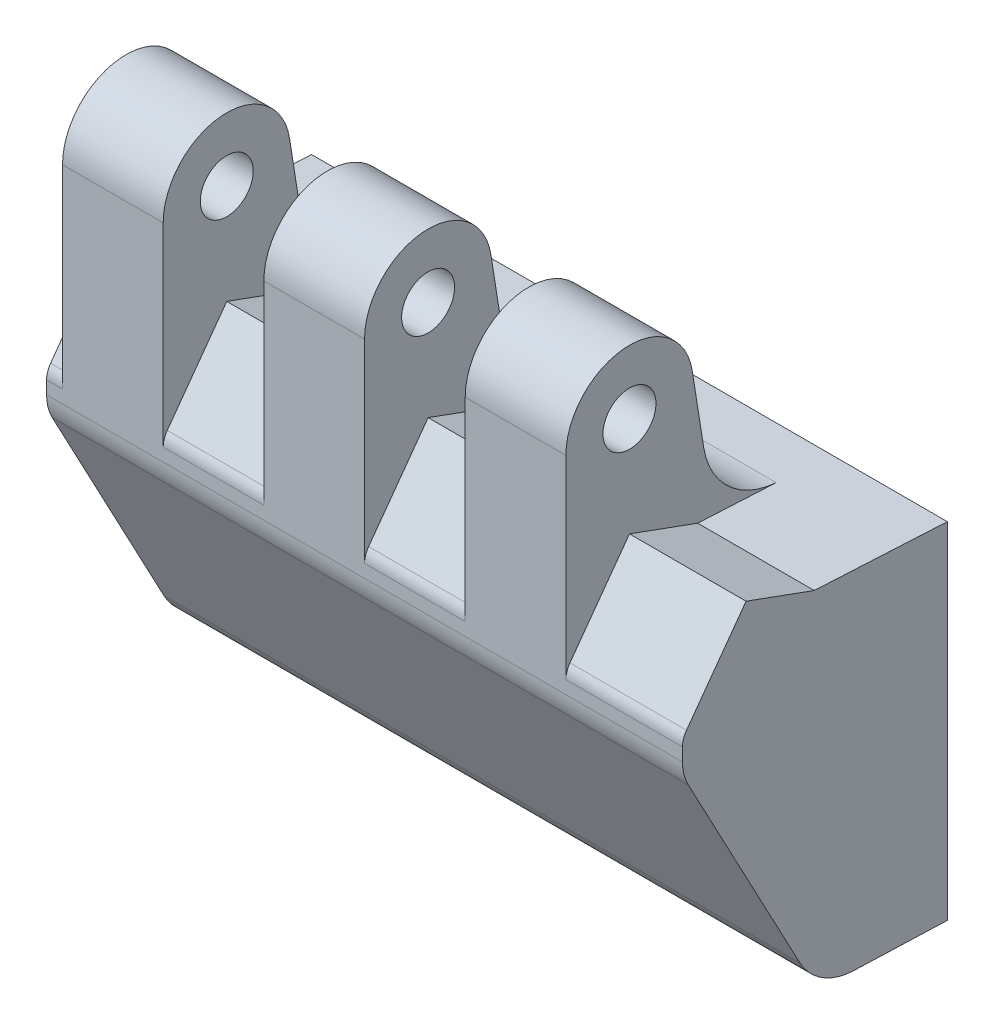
ISO-10303-21;
HEADER;
FILE_DESCRIPTION(('STEP AP214'),'2;1');
FILE_NAME('part.step','',(''),(''),'','','');
FILE_SCHEMA(('AUTOMOTIVE_DESIGN { 1 0 10303 214 1 1 1 1 }'));
ENDSEC;
DATA;
#1=APPLICATION_CONTEXT('core data for automotive mechanical design processes');
#2=APPLICATION_PROTOCOL_DEFINITION('international standard','automotive_design',2000,#1);
#3=PRODUCT_CONTEXT('',#1,'mechanical');
#4=PRODUCT('Part','Part','',(#3));
#5=PRODUCT_RELATED_PRODUCT_CATEGORY('part','',(#4));
#6=PRODUCT_DEFINITION_FORMATION('','',#4);
#7=PRODUCT_DEFINITION_CONTEXT('part definition',#1,'design');
#8=PRODUCT_DEFINITION('design','',#6,#7);
#9=PRODUCT_DEFINITION_SHAPE('','',#8);
#10=(LENGTH_UNIT() NAMED_UNIT(*) SI_UNIT(.MILLI.,.METRE.));
#11=(NAMED_UNIT(*) PLANE_ANGLE_UNIT() SI_UNIT($,.RADIAN.));
#12=(NAMED_UNIT(*) SI_UNIT($,.STERADIAN.) SOLID_ANGLE_UNIT());
#13=UNCERTAINTY_MEASURE_WITH_UNIT(LENGTH_MEASURE(1.E-05),#10,'distance_accuracy_value','');
#14=(GEOMETRIC_REPRESENTATION_CONTEXT(3) GLOBAL_UNCERTAINTY_ASSIGNED_CONTEXT((#13)) GLOBAL_UNIT_ASSIGNED_CONTEXT((#10,
#11,#12)) REPRESENTATION_CONTEXT('',''));
#15=CARTESIAN_POINT('',(0.,0.,0.));
#16=DIRECTION('',(0.,0.,1.));
#17=DIRECTION('',(1.,0.,0.));
#18=AXIS2_PLACEMENT_3D('',#15,#16,#17);
#19=CARTESIAN_POINT('',(22.75,8.79,0.));
#20=DIRECTION('',(0.,0.998629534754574,-0.0523359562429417));
#21=DIRECTION('',(0.,0.0523359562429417,0.998629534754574));
#22=AXIS2_PLACEMENT_3D('',#19,#20,#21);
#23=PLANE('',#22);
#24=DIRECTION('',(-1.,0.,0.));
#25=VECTOR('',#24,1.);
#26=CARTESIAN_POINT('',(22.75,8.79,0.));
#27=LINE('',#26,#25);
#28=CARTESIAN_POINT('',(22.5,8.79,0.));
#29=VERTEX_POINT('',#28);
#30=CARTESIAN_POINT('',(-7.5,8.79,0.));
#31=VERTEX_POINT('',#30);
#32=EDGE_CURVE('E258',#29,#31,#27,.T.);
#33=ORIENTED_EDGE('',*,*,#32,.T.);
#34=DIRECTION('',(0.,-0.0523359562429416,-0.998629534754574));
#35=VECTOR('',#34,1.);
#36=CARTESIAN_POINT('',(-7.5,9.1193067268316,6.2835466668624));
#37=LINE('',#36,#35);
#38=CARTESIAN_POINT('',(-7.5,9.1193067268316,6.2835466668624));
#39=VERTEX_POINT('',#38);
#40=EDGE_CURVE('E239',#39,#31,#37,.T.);
#41=ORIENTED_EDGE('',*,*,#40,.F.);
#42=DIRECTION('',(-1.,0.,0.));
#43=VECTOR('',#42,1.);
#44=CARTESIAN_POINT('',(22.75,9.1193067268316,6.2835466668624));
#45=LINE('',#44,#43);
#46=CARTESIAN_POINT('',(-6.75,9.1193067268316,6.2835466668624));
#47=VERTEX_POINT('',#46);
#48=EDGE_CURVE('E387',#47,#39,#45,.T.);
#49=ORIENTED_EDGE('',*,*,#48,.F.);
#50=DIRECTION('',(0.,0.0523359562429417,0.998629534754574));
#51=VECTOR('',#50,1.);
#52=CARTESIAN_POINT('',(-6.75,8.79,0.));
#53=LINE('',#52,#51);
#54=CARTESIAN_POINT('',(-6.75,8.92513741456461,2.57857547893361));
#55=VERTEX_POINT('',#54);
#56=EDGE_CURVE('E425',#55,#47,#53,.T.);
#57=ORIENTED_EDGE('',*,*,#56,.F.);
#58=DIRECTION('',(1.,0.,0.));
#59=VECTOR('',#58,1.);
#60=CARTESIAN_POINT('',(-6.75,8.92513741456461,2.57857547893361));
#61=LINE('',#60,#59);
#62=CARTESIAN_POINT('',(-2.,8.9251374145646,2.5785754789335));
#63=VERTEX_POINT('',#62);
#64=EDGE_CURVE('E9',#63,#55,#61,.F.);
#65=ORIENTED_EDGE('',*,*,#64,.F.);
#66=DIRECTION('',(0.,0.0523359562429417,0.998629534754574));
#67=VECTOR('',#66,1.);
#68=CARTESIAN_POINT('',(-2.,8.79,0.));
#69=LINE('',#68,#67);
#70=CARTESIAN_POINT('',(-2.,9.1193067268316,6.2835466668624));
#71=VERTEX_POINT('',#70);
#72=EDGE_CURVE('E407',#63,#71,#69,.T.);
#73=ORIENTED_EDGE('',*,*,#72,.T.);
#74=CARTESIAN_POINT('',(2.75,9.1193067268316,6.2835466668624));
#75=VERTEX_POINT('',#74);
#76=EDGE_CURVE('E391',#75,#71,#45,.T.);
#77=ORIENTED_EDGE('',*,*,#76,.F.);
#78=DIRECTION('',(0.,0.0523359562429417,0.998629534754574));
#79=VECTOR('',#78,1.);
#80=CARTESIAN_POINT('',(2.75,8.79,0.));
#81=LINE('',#80,#79);
#82=CARTESIAN_POINT('',(2.75,8.92513741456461,2.57857547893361));
#83=VERTEX_POINT('',#82);
#84=EDGE_CURVE('E362',#83,#75,#81,.T.);
#85=ORIENTED_EDGE('',*,*,#84,.F.);
#86=DIRECTION('',(1.,0.,0.));
#87=VECTOR('',#86,1.);
#88=CARTESIAN_POINT('',(2.75,8.92513741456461,2.57857547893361));
#89=LINE('',#88,#87);
#90=CARTESIAN_POINT('',(7.5,8.9251374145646,2.5785754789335));
#91=VERTEX_POINT('',#90);
#92=EDGE_CURVE('E257',#91,#83,#89,.F.);
#93=ORIENTED_EDGE('',*,*,#92,.F.);
#94=DIRECTION('',(0.,0.0523359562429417,0.998629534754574));
#95=VECTOR('',#94,1.);
#96=CARTESIAN_POINT('',(7.5,8.79,0.));
#97=LINE('',#96,#95);
#98=CARTESIAN_POINT('',(7.5,9.1193067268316,6.2835466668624));
#99=VERTEX_POINT('',#98);
#100=EDGE_CURVE('E350',#91,#99,#97,.T.);
#101=ORIENTED_EDGE('',*,*,#100,.T.);
#102=CARTESIAN_POINT('',(12.25,9.1193067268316,6.2835466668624));
#103=VERTEX_POINT('',#102);
#104=EDGE_CURVE('E390',#103,#99,#45,.T.);
#105=ORIENTED_EDGE('',*,*,#104,.F.);
#106=DIRECTION('',(0.,0.0523359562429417,0.998629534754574));
#107=VECTOR('',#106,1.);
#108=CARTESIAN_POINT('',(12.25,8.79,0.));
#109=LINE('',#108,#107);
#110=CARTESIAN_POINT('',(12.25,8.9251374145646,2.5785754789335));
#111=VERTEX_POINT('',#110);
#112=EDGE_CURVE('E275',#111,#103,#109,.T.);
#113=ORIENTED_EDGE('',*,*,#112,.F.);
#114=DIRECTION('',(-1.,0.,0.));
#115=VECTOR('',#114,1.);
#116=CARTESIAN_POINT('',(17.,8.92513741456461,2.57857547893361));
#117=LINE('',#116,#115);
#118=CARTESIAN_POINT('',(17.,8.9251374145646,2.5785754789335));
#119=VERTEX_POINT('',#118);
#120=EDGE_CURVE('E22',#111,#119,#117,.F.);
#121=ORIENTED_EDGE('',*,*,#120,.T.);
#122=DIRECTION('',(0.,0.0523359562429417,0.998629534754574));
#123=VECTOR('',#122,1.);
#124=CARTESIAN_POINT('',(17.,8.79,0.));
#125=LINE('',#124,#123);
#126=CARTESIAN_POINT('',(17.,9.1193067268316,6.2835466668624));
#127=VERTEX_POINT('',#126);
#128=EDGE_CURVE('E272',#119,#127,#125,.T.);
#129=ORIENTED_EDGE('',*,*,#128,.T.);
#130=CARTESIAN_POINT('',(22.5,9.1193067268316,6.2835466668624));
#131=VERTEX_POINT('',#130);
#132=EDGE_CURVE('E262',#131,#127,#45,.T.);
#133=ORIENTED_EDGE('',*,*,#132,.F.);
#134=DIRECTION('',(0.,0.0523359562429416,0.998629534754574));
#135=VECTOR('',#134,1.);
#136=CARTESIAN_POINT('',(22.5,8.79,0.));
#137=LINE('',#136,#135);
#138=EDGE_CURVE('E481',#29,#131,#137,.T.);
#139=ORIENTED_EDGE('',*,*,#138,.F.);
#140=EDGE_LOOP('',(#33,#41,#49,#57,#65,#73,#77,#85,#93,#101,#105,#113,#121,#129,#133,#139));
#141=FACE_BOUND('',#140,.T.);
#142=ADVANCED_FACE('F14',(#141),#23,.T.);
#143=CARTESIAN_POINT('',(22.75,-7.345750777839,4.41711979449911));
#144=DIRECTION('',(0.,-0.999390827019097,0.0348994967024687));
#145=DIRECTION('',(0.,-0.0348994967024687,-0.999390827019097));
#146=AXIS2_PLACEMENT_3D('',#143,#144,#145);
#147=PLANE('',#146);
#148=DIRECTION('',(-1.,0.,0.));
#149=VECTOR('',#148,1.);
#150=CARTESIAN_POINT('',(22.75,-7.345750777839,4.41711979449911));
#151=LINE('',#150,#149);
#152=CARTESIAN_POINT('',(22.5,-7.345750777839,4.41711979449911));
#153=VERTEX_POINT('',#152);
#154=CARTESIAN_POINT('',(-7.5,-7.345750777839,4.41711979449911));
#155=VERTEX_POINT('',#154);
#156=EDGE_CURVE('E251',#153,#155,#151,.T.);
#157=ORIENTED_EDGE('',*,*,#156,.T.);
#158=DIRECTION('',(0.,0.0348994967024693,0.999390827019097));
#159=VECTOR('',#158,1.);
#160=CARTESIAN_POINT('',(-7.5,-7.5,0.));
#161=LINE('',#160,#159);
#162=CARTESIAN_POINT('',(-7.5,-7.5,0.));
#163=VERTEX_POINT('',#162);
#164=EDGE_CURVE('E236',#163,#155,#161,.T.);
#165=ORIENTED_EDGE('',*,*,#164,.F.);
#166=DIRECTION('',(-1.,0.,0.));
#167=VECTOR('',#166,1.);
#168=CARTESIAN_POINT('',(22.75,-7.5,0.));
#169=LINE('',#168,#167);
#170=CARTESIAN_POINT('',(22.5,-7.5,0.));
#171=VERTEX_POINT('',#170);
#172=EDGE_CURVE('E249',#171,#163,#169,.T.);
#173=ORIENTED_EDGE('',*,*,#172,.F.);
#174=DIRECTION('',(0.,-0.0348994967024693,-0.999390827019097));
#175=VECTOR('',#174,1.);
#176=CARTESIAN_POINT('',(22.5,-7.345750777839,4.41711979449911));
#177=LINE('',#176,#175);
#178=EDGE_CURVE('E485',#153,#171,#177,.T.);
#179=ORIENTED_EDGE('',*,*,#178,.F.);
#180=EDGE_LOOP('',(#157,#165,#173,#179));
#181=FACE_BOUND('',#180,.T.);
#182=ADVANCED_FACE('F16',(#181),#147,.T.);
#183=CARTESIAN_POINT('',(22.75,-7.5,0.));
#184=DIRECTION('',(0.,0.,-1.));
#185=DIRECTION('',(1.,0.,0.));
#186=AXIS2_PLACEMENT_3D('',#183,#184,#185);
#187=PLANE('',#186);
#188=CARTESIAN_POINT('',(15.,0.,0.));
#189=DIRECTION('',(0.,0.,1.));
#190=DIRECTION('',(1.,0.,0.));
#191=AXIS2_PLACEMENT_3D('',#188,#189,#190);
#192=CIRCLE('',#191,1.5);
#193=CARTESIAN_POINT('',(16.5,0.,0.));
#194=VERTEX_POINT('',#193);
#195=EDGE_CURVE('E497',#194,#194,#192,.T.);
#196=ORIENTED_EDGE('',*,*,#195,.T.);
#197=EDGE_LOOP('',(#196));
#198=FACE_BOUND('',#197,.T.);
#199=CARTESIAN_POINT('',(0.,0.,0.));
#200=DIRECTION('',(0.,0.,1.));
#201=DIRECTION('',(1.,0.,0.));
#202=AXIS2_PLACEMENT_3D('',#199,#200,#201);
#203=CIRCLE('',#202,1.5);
#204=CARTESIAN_POINT('',(1.5,0.,0.));
#205=VERTEX_POINT('',#204);
#206=EDGE_CURVE('E501',#205,#205,#203,.T.);
#207=ORIENTED_EDGE('',*,*,#206,.T.);
#208=EDGE_LOOP('',(#207));
#209=FACE_BOUND('',#208,.T.);
#210=ORIENTED_EDGE('',*,*,#172,.T.);
#211=DIRECTION('',(0.,-1.,0.));
#212=VECTOR('',#211,1.);
#213=CARTESIAN_POINT('',(-7.5,8.79,0.));
#214=LINE('',#213,#212);
#215=EDGE_CURVE('E233',#31,#163,#214,.T.);
#216=ORIENTED_EDGE('',*,*,#215,.F.);
#217=ORIENTED_EDGE('',*,*,#32,.F.);
#218=DIRECTION('',(0.,1.,0.));
#219=VECTOR('',#218,1.);
#220=CARTESIAN_POINT('',(22.5,-7.5,0.));
#221=LINE('',#220,#219);
#222=EDGE_CURVE('E256',#171,#29,#221,.T.);
#223=ORIENTED_EDGE('',*,*,#222,.F.);
#224=EDGE_LOOP('',(#210,#216,#217,#223));
#225=FACE_BOUND('',#224,.T.);
#226=ADVANCED_FACE('F255',(#198,#209,#225),#187,.T.);
#227=CARTESIAN_POINT('',(22.75,5.8359345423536,12.5));
#228=DIRECTION('',(0.,0.,1.));
#229=DIRECTION('',(-1.,0.,0.));
#230=AXIS2_PLACEMENT_3D('',#227,#228,#229);
#231=PLANE('',#230);
#232=DIRECTION('',(-1.,0.,0.));
#233=VECTOR('',#232,1.);
#234=CARTESIAN_POINT('',(22.75,5.8359345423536,12.5));
#235=LINE('',#234,#233);
#236=CARTESIAN_POINT('',(-6.75,5.8359345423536,12.5));
#237=VERTEX_POINT('',#236);
#238=CARTESIAN_POINT('',(-7.5,5.8359345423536,12.5));
#239=VERTEX_POINT('',#238);
#240=EDGE_CURVE('E375',#237,#239,#235,.T.);
#241=ORIENTED_EDGE('',*,*,#240,.T.);
#242=DIRECTION('',(0.,1.,0.));
#243=VECTOR('',#242,1.);
#244=CARTESIAN_POINT('',(-7.5,5.22184224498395,12.5));
#245=LINE('',#244,#243);
#246=CARTESIAN_POINT('',(-7.5,5.22184224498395,12.5));
#247=VERTEX_POINT('',#246);
#248=EDGE_CURVE('E29',#247,#239,#245,.T.);
#249=ORIENTED_EDGE('',*,*,#248,.F.);
#250=DIRECTION('',(-1.,0.,0.));
#251=VECTOR('',#250,1.);
#252=CARTESIAN_POINT('',(22.75,5.2218422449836,12.5));
#253=LINE('',#252,#251);
#254=CARTESIAN_POINT('',(22.5,5.2218422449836,12.5));
#255=VERTEX_POINT('',#254);
#256=EDGE_CURVE('E372',#255,#247,#253,.T.);
#257=ORIENTED_EDGE('',*,*,#256,.F.);
#258=DIRECTION('',(0.,-1.,0.));
#259=VECTOR('',#258,1.);
#260=CARTESIAN_POINT('',(22.5,5.8359345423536,12.5));
#261=LINE('',#260,#259);
#262=CARTESIAN_POINT('',(22.5,5.8359345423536,12.5));
#263=VERTEX_POINT('',#262);
#264=EDGE_CURVE('E492',#263,#255,#261,.T.);
#265=ORIENTED_EDGE('',*,*,#264,.F.);
#266=CARTESIAN_POINT('',(17.,5.8359345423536,12.5));
#267=VERTEX_POINT('',#266);
#268=EDGE_CURVE('E376',#263,#267,#235,.T.);
#269=ORIENTED_EDGE('',*,*,#268,.T.);
#270=DIRECTION('',(0.,-1.,0.));
#271=VECTOR('',#270,1.);
#272=CARTESIAN_POINT('',(17.,15.,12.5));
#273=LINE('',#272,#271);
#274=CARTESIAN_POINT('',(17.,15.,12.5));
#275=VERTEX_POINT('',#274);
#276=EDGE_CURVE('E288',#275,#267,#273,.T.);
#277=ORIENTED_EDGE('',*,*,#276,.F.);
#278=DIRECTION('',(-1.,0.,0.));
#279=VECTOR('',#278,1.);
#280=CARTESIAN_POINT('',(17.,15.,12.5));
#281=LINE('',#280,#279);
#282=CARTESIAN_POINT('',(12.25,15.,12.5));
#283=VERTEX_POINT('',#282);
#284=EDGE_CURVE('E452',#275,#283,#281,.T.);
#285=ORIENTED_EDGE('',*,*,#284,.T.);
#286=DIRECTION('',(0.,-1.,0.));
#287=VECTOR('',#286,1.);
#288=CARTESIAN_POINT('',(12.25,15.,12.5));
#289=LINE('',#288,#287);
#290=CARTESIAN_POINT('',(12.25,5.8359345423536,12.5));
#291=VERTEX_POINT('',#290);
#292=EDGE_CURVE('E428',#283,#291,#289,.T.);
#293=ORIENTED_EDGE('',*,*,#292,.T.);
#294=CARTESIAN_POINT('',(7.5,5.8359345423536,12.5));
#295=VERTEX_POINT('',#294);
#296=EDGE_CURVE('E379',#291,#295,#235,.T.);
#297=ORIENTED_EDGE('',*,*,#296,.T.);
#298=DIRECTION('',(0.,-1.,0.));
#299=VECTOR('',#298,1.);
#300=CARTESIAN_POINT('',(7.5,15.,12.5));
#301=LINE('',#300,#299);
#302=CARTESIAN_POINT('',(7.5,15.,12.5));
#303=VERTEX_POINT('',#302);
#304=EDGE_CURVE('E296',#303,#295,#301,.T.);
#305=ORIENTED_EDGE('',*,*,#304,.F.);
#306=DIRECTION('',(1.,0.,0.));
#307=VECTOR('',#306,1.);
#308=CARTESIAN_POINT('',(2.75,15.,12.5));
#309=LINE('',#308,#307);
#310=CARTESIAN_POINT('',(2.75,15.,12.5));
#311=VERTEX_POINT('',#310);
#312=EDGE_CURVE('E332',#311,#303,#309,.T.);
#313=ORIENTED_EDGE('',*,*,#312,.F.);
#314=DIRECTION('',(0.,-1.,0.));
#315=VECTOR('',#314,1.);
#316=CARTESIAN_POINT('',(2.75,15.,12.5));
#317=LINE('',#316,#315);
#318=CARTESIAN_POINT('',(2.75,5.8359345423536,12.5));
#319=VERTEX_POINT('',#318);
#320=EDGE_CURVE('E319',#311,#319,#317,.T.);
#321=ORIENTED_EDGE('',*,*,#320,.T.);
#322=CARTESIAN_POINT('',(-2.,5.8359345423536,12.5));
#323=VERTEX_POINT('',#322);
#324=EDGE_CURVE('E380',#319,#323,#235,.T.);
#325=ORIENTED_EDGE('',*,*,#324,.T.);
#326=DIRECTION('',(0.,-1.,0.));
#327=VECTOR('',#326,1.);
#328=CARTESIAN_POINT('',(-2.,15.,12.5));
#329=LINE('',#328,#327);
#330=CARTESIAN_POINT('',(-2.,15.,12.5));
#331=VERTEX_POINT('',#330);
#332=EDGE_CURVE('E507',#331,#323,#329,.T.);
#333=ORIENTED_EDGE('',*,*,#332,.F.);
#334=DIRECTION('',(1.,0.,0.));
#335=VECTOR('',#334,1.);
#336=CARTESIAN_POINT('',(-6.75,15.,12.5));
#337=LINE('',#336,#335);
#338=CARTESIAN_POINT('',(-6.75,15.,12.5));
#339=VERTEX_POINT('',#338);
#340=EDGE_CURVE('E539',#339,#331,#337,.T.);
#341=ORIENTED_EDGE('',*,*,#340,.F.);
#342=DIRECTION('',(0.,-1.,0.));
#343=VECTOR('',#342,1.);
#344=CARTESIAN_POINT('',(-6.75,15.,12.5));
#345=LINE('',#344,#343);
#346=EDGE_CURVE('E526',#339,#237,#345,.T.);
#347=ORIENTED_EDGE('',*,*,#346,.T.);
#348=EDGE_LOOP('',(#241,#249,#257,#265,#269,#277,#285,#293,#297,#305,#313,#321,#325,#333,#341,#347));
#349=FACE_BOUND('',#348,.T.);
#350=ADVANCED_FACE('F601',(#349),#231,.T.);
#351=CARTESIAN_POINT('',(22.75,5.22184224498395,10.2499999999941));
#352=DIRECTION('',(-1.,0.,0.));
#353=DIRECTION('',(0.,1.,0.));
#354=AXIS2_PLACEMENT_3D('',#351,#352,#353);
#355=CYLINDRICAL_SURFACE('',#354,2.2500000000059);
#356=ORIENTED_EDGE('',*,*,#256,.T.);
#357=CARTESIAN_POINT('',(-7.5,5.22184224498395,10.2499999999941));
#358=DIRECTION('',(-1.,0.,0.));
#359=DIRECTION('',(0.,0.,1.));
#360=AXIS2_PLACEMENT_3D('',#357,#358,#359);
#361=CIRCLE('',#360,2.2500000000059);
#362=CARTESIAN_POINT('',(-7.5,4.165531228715,12.236632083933));
#363=VERTEX_POINT('',#362);
#364=EDGE_CURVE('E593',#363,#247,#361,.T.);
#365=ORIENTED_EDGE('',*,*,#364,.F.);
#366=DIRECTION('',(-1.,0.,0.));
#367=VECTOR('',#366,1.);
#368=CARTESIAN_POINT('',(22.75,4.165531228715,12.236632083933));
#369=LINE('',#368,#367);
#370=CARTESIAN_POINT('',(22.5,4.165531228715,12.236632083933));
#371=VERTEX_POINT('',#370);
#372=EDGE_CURVE('E369',#371,#363,#369,.T.);
#373=ORIENTED_EDGE('',*,*,#372,.F.);
#374=CARTESIAN_POINT('',(22.5,5.22184224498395,10.2499999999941));
#375=DIRECTION('',(1.,0.,0.));
#376=DIRECTION('',(0.,0.,-1.));
#377=AXIS2_PLACEMENT_3D('',#374,#375,#376);
#378=CIRCLE('',#377,2.2500000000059);
#379=EDGE_CURVE('E494',#255,#371,#378,.T.);
#380=ORIENTED_EDGE('',*,*,#379,.F.);
#381=EDGE_LOOP('',(#356,#365,#373,#380));
#382=FACE_BOUND('',#381,.T.);
#383=ADVANCED_FACE('F604',(#382),#355,.T.);
#384=CARTESIAN_POINT('',(22.75,4.165531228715,12.236632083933));
#385=DIRECTION('',(0.,-0.469471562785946,0.882947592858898));
#386=DIRECTION('',(0.,-0.882947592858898,-0.469471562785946));
#387=AXIS2_PLACEMENT_3D('',#384,#385,#386);
#388=PLANE('',#387);
#389=ORIENTED_EDGE('',*,*,#372,.T.);
#390=DIRECTION('',(0.,0.882947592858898,0.469471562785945));
#391=VECTOR('',#390,1.);
#392=CARTESIAN_POINT('',(-7.5,-5.755992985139,6.96126408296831));
#393=LINE('',#392,#391);
#394=CARTESIAN_POINT('',(-7.5,-5.75599298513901,6.96126408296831));
#395=VERTEX_POINT('',#394);
#396=EDGE_CURVE('E591',#395,#363,#393,.T.);
#397=ORIENTED_EDGE('',*,*,#396,.F.);
#398=DIRECTION('',(-1.,0.,0.));
#399=VECTOR('',#398,1.);
#400=CARTESIAN_POINT('',(22.75,-5.755992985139,6.9612640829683));
#401=LINE('',#400,#399);
#402=CARTESIAN_POINT('',(22.5,-5.755992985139,6.9612640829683));
#403=VERTEX_POINT('',#402);
#404=EDGE_CURVE('E366',#403,#395,#401,.T.);
#405=ORIENTED_EDGE('',*,*,#404,.F.);
#406=DIRECTION('',(0.,-0.882947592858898,-0.469471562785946));
#407=VECTOR('',#406,1.);
#408=CARTESIAN_POINT('',(22.5,4.165531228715,12.236632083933));
#409=LINE('',#408,#407);
#410=EDGE_CURVE('E37',#371,#403,#409,.T.);
#411=ORIENTED_EDGE('',*,*,#410,.F.);
#412=EDGE_LOOP('',(#389,#397,#405,#411));
#413=FACE_BOUND('',#412,.T.);
#414=ADVANCED_FACE('F606',(#413),#388,.T.);
#415=CARTESIAN_POINT('',(22.75,-4.34757829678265,4.31242130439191));
#416=DIRECTION('',(-1.,0.,0.));
#417=DIRECTION('',(0.,1.,0.));
#418=AXIS2_PLACEMENT_3D('',#415,#416,#417);
#419=CYLINDRICAL_SURFACE('',#418,2.99999999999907);
#420=ORIENTED_EDGE('',*,*,#404,.T.);
#421=CARTESIAN_POINT('',(-7.5,-4.34757829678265,4.31242130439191));
#422=DIRECTION('',(-1.,0.,0.));
#423=DIRECTION('',(0.,0.,1.));
#424=AXIS2_PLACEMENT_3D('',#421,#422,#423);
#425=CIRCLE('',#424,2.99999999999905);
#426=EDGE_CURVE('E252',#155,#395,#425,.T.);
#427=ORIENTED_EDGE('',*,*,#426,.F.);
#428=ORIENTED_EDGE('',*,*,#156,.F.);
#429=CARTESIAN_POINT('',(22.5,-4.34757829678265,4.31242130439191));
#430=DIRECTION('',(1.,0.,0.));
#431=DIRECTION('',(0.,0.,-1.));
#432=AXIS2_PLACEMENT_3D('',#429,#430,#431);
#433=CIRCLE('',#432,2.99999999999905);
#434=EDGE_CURVE('E585',#403,#153,#433,.T.);
#435=ORIENTED_EDGE('',*,*,#434,.F.);
#436=EDGE_LOOP('',(#420,#427,#428,#435));
#437=FACE_BOUND('',#436,.T.);
#438=ADVANCED_FACE('F588',(#437),#419,.T.);
#439=CARTESIAN_POINT('',(22.75,9.1193067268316,6.2835466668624));
#440=DIRECTION('',(0.,0.939692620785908,-0.342020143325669));
#441=DIRECTION('',(0.,0.342020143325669,0.939692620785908));
#442=AXIS2_PLACEMENT_3D('',#439,#440,#441);
#443=PLANE('',#442);
#444=ORIENTED_EDGE('',*,*,#48,.T.);
#445=DIRECTION('',(0.,-0.342020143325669,-0.939692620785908));
#446=VECTOR('',#445,1.);
#447=CARTESIAN_POINT('',(-7.5,10.29,9.5));
#448=LINE('',#447,#446);
#449=CARTESIAN_POINT('',(-7.5,10.29,9.5));
#450=VERTEX_POINT('',#449);
#451=EDGE_CURVE('E578',#450,#39,#448,.T.);
#452=ORIENTED_EDGE('',*,*,#451,.F.);
#453=DIRECTION('',(-1.,0.,0.));
#454=VECTOR('',#453,1.);
#455=CARTESIAN_POINT('',(22.75,10.29,9.5));
#456=LINE('',#455,#454);
#457=CARTESIAN_POINT('',(-6.75,10.29,9.5));
#458=VERTEX_POINT('',#457);
#459=EDGE_CURVE('E383',#458,#450,#456,.T.);
#460=ORIENTED_EDGE('',*,*,#459,.F.);
#461=DIRECTION('',(0.,0.342020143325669,0.939692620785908));
#462=VECTOR('',#461,1.);
#463=CARTESIAN_POINT('',(-6.75,9.1193067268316,6.2835466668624));
#464=LINE('',#463,#462);
#465=EDGE_CURVE('E422',#47,#458,#464,.T.);
#466=ORIENTED_EDGE('',*,*,#465,.F.);
#467=EDGE_LOOP('',(#444,#452,#460,#466));
#468=FACE_BOUND('',#467,.T.);
#469=ADVANCED_FACE('F615',(#468),#443,.T.);
#470=CARTESIAN_POINT('',(22.75,10.29,9.5));
#471=DIRECTION('',(0.,0.587785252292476,0.809016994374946));
#472=DIRECTION('',(0.,-0.809016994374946,0.587785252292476));
#473=AXIS2_PLACEMENT_3D('',#470,#471,#472);
#474=PLANE('',#473);
#475=ORIENTED_EDGE('',*,*,#459,.T.);
#476=DIRECTION('',(0.,0.809016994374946,-0.587785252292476));
#477=VECTOR('',#476,1.);
#478=CARTESIAN_POINT('',(-7.5,6.423719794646,12.309016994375));
#479=LINE('',#478,#477);
#480=CARTESIAN_POINT('',(-7.5,6.423719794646,12.309016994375));
#481=VERTEX_POINT('',#480);
#482=EDGE_CURVE('E575',#481,#450,#479,.T.);
#483=ORIENTED_EDGE('',*,*,#482,.F.);
#484=DIRECTION('',(-1.,0.,0.));
#485=VECTOR('',#484,1.);
#486=CARTESIAN_POINT('',(22.75,6.423719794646,12.309016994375));
#487=LINE('',#486,#485);
#488=CARTESIAN_POINT('',(-6.75,6.423719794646,12.309016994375));
#489=VERTEX_POINT('',#488);
#490=EDGE_CURVE('E378',#489,#481,#487,.T.);
#491=ORIENTED_EDGE('',*,*,#490,.F.);
#492=DIRECTION('',(0.,-0.809016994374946,0.587785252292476));
#493=VECTOR('',#492,1.);
#494=CARTESIAN_POINT('',(-6.75,10.29,9.5));
#495=LINE('',#494,#493);
#496=EDGE_CURVE('E414',#458,#489,#495,.T.);
#497=ORIENTED_EDGE('',*,*,#496,.F.);
#498=EDGE_LOOP('',(#475,#483,#491,#497));
#499=FACE_BOUND('',#498,.T.);
#500=ADVANCED_FACE('F574',(#499),#474,.T.);
#501=CARTESIAN_POINT('',(22.75,5.83593454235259,11.4999999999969));
#502=DIRECTION('',(-1.,0.,0.));
#503=DIRECTION('',(0.,1.,0.));
#504=AXIS2_PLACEMENT_3D('',#501,#502,#503);
#505=CYLINDRICAL_SURFACE('',#504,1.00000000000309);
#506=ORIENTED_EDGE('',*,*,#490,.T.);
#507=CARTESIAN_POINT('',(-7.5,5.83593454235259,11.4999999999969));
#508=DIRECTION('',(-1.,0.,0.));
#509=DIRECTION('',(0.,0.,1.));
#510=AXIS2_PLACEMENT_3D('',#507,#508,#509);
#511=CIRCLE('',#510,1.0000000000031);
#512=EDGE_CURVE('E569',#239,#481,#511,.T.);
#513=ORIENTED_EDGE('',*,*,#512,.F.);
#514=ORIENTED_EDGE('',*,*,#240,.F.);
#515=CARTESIAN_POINT('',(-6.75,5.83593454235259,11.4999999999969));
#516=DIRECTION('',(-1.,0.,0.));
#517=DIRECTION('',(0.,-1.,0.));
#518=AXIS2_PLACEMENT_3D('',#515,#516,#517);
#519=CIRCLE('',#518,1.00000000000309);
#520=EDGE_CURVE('E411',#489,#237,#519,.F.);
#521=ORIENTED_EDGE('',*,*,#520,.F.);
#522=EDGE_LOOP('',(#506,#513,#514,#521));
#523=FACE_BOUND('',#522,.T.);
#524=ADVANCED_FACE('F567',(#523),#505,.T.);
#525=CARTESIAN_POINT('',(22.5,10.29,9.5));
#526=VERTEX_POINT('',#525);
#527=CARTESIAN_POINT('',(17.,10.29,9.5));
#528=VERTEX_POINT('',#527);
#529=EDGE_CURVE('E386',#526,#528,#456,.T.);
#530=ORIENTED_EDGE('',*,*,#529,.F.);
#531=DIRECTION('',(0.,0.342020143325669,0.939692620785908));
#532=VECTOR('',#531,1.);
#533=CARTESIAN_POINT('',(22.5,9.1193067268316,6.2835466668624));
#534=LINE('',#533,#532);
#535=EDGE_CURVE('E479',#131,#526,#534,.T.);
#536=ORIENTED_EDGE('',*,*,#535,.F.);
#537=ORIENTED_EDGE('',*,*,#132,.T.);
#538=DIRECTION('',(0.,0.342020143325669,0.939692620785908));
#539=VECTOR('',#538,1.);
#540=CARTESIAN_POINT('',(17.,9.1193067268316,6.2835466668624));
#541=LINE('',#540,#539);
#542=EDGE_CURVE('E295',#127,#528,#541,.T.);
#543=ORIENTED_EDGE('',*,*,#542,.T.);
#544=EDGE_LOOP('',(#530,#536,#537,#543));
#545=FACE_BOUND('',#544,.T.);
#546=ADVANCED_FACE('F478',(#545),#443,.T.);
#547=CARTESIAN_POINT('',(22.5,6.423719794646,12.309016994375));
#548=VERTEX_POINT('',#547);
#549=CARTESIAN_POINT('',(17.,6.423719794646,12.309016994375));
#550=VERTEX_POINT('',#549);
#551=EDGE_CURVE('E381',#548,#550,#487,.T.);
#552=ORIENTED_EDGE('',*,*,#551,.F.);
#553=DIRECTION('',(0.,-0.809016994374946,0.587785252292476));
#554=VECTOR('',#553,1.);
#555=CARTESIAN_POINT('',(22.5,10.29,9.5));
#556=LINE('',#555,#554);
#557=EDGE_CURVE('E480',#526,#548,#556,.T.);
#558=ORIENTED_EDGE('',*,*,#557,.F.);
#559=ORIENTED_EDGE('',*,*,#529,.T.);
#560=DIRECTION('',(0.,-0.809016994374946,0.587785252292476));
#561=VECTOR('',#560,1.);
#562=CARTESIAN_POINT('',(17.,10.29,9.5));
#563=LINE('',#562,#561);
#564=EDGE_CURVE('E301',#528,#550,#563,.T.);
#565=ORIENTED_EDGE('',*,*,#564,.T.);
#566=EDGE_LOOP('',(#552,#558,#559,#565));
#567=FACE_BOUND('',#566,.T.);
#568=ADVANCED_FACE('F474',(#567),#474,.T.);
#569=ORIENTED_EDGE('',*,*,#268,.F.);
#570=CARTESIAN_POINT('',(22.5,5.83593454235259,11.4999999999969));
#571=DIRECTION('',(1.,0.,0.));
#572=DIRECTION('',(0.,0.,-1.));
#573=AXIS2_PLACEMENT_3D('',#570,#571,#572);
#574=CIRCLE('',#573,1.0000000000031);
#575=EDGE_CURVE('E490',#548,#263,#574,.T.);
#576=ORIENTED_EDGE('',*,*,#575,.F.);
#577=ORIENTED_EDGE('',*,*,#551,.T.);
#578=CARTESIAN_POINT('',(17.,5.83593454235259,11.4999999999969));
#579=DIRECTION('',(-1.,0.,0.));
#580=DIRECTION('',(0.,-1.,0.));
#581=AXIS2_PLACEMENT_3D('',#578,#579,#580);
#582=CIRCLE('',#581,1.00000000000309);
#583=EDGE_CURVE('E469',#550,#267,#582,.F.);
#584=ORIENTED_EDGE('',*,*,#583,.T.);
#585=EDGE_LOOP('',(#569,#576,#577,#584));
#586=FACE_BOUND('',#585,.T.);
#587=ADVANCED_FACE('F726',(#586),#505,.T.);
#588=ORIENTED_EDGE('',*,*,#104,.T.);
#589=DIRECTION('',(0.,0.342020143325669,0.939692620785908));
#590=VECTOR('',#589,1.);
#591=CARTESIAN_POINT('',(7.5,9.1193067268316,6.2835466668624));
#592=LINE('',#591,#590);
#593=CARTESIAN_POINT('',(7.5,10.29,9.5));
#594=VERTEX_POINT('',#593);
#595=EDGE_CURVE('E347',#99,#594,#592,.T.);
#596=ORIENTED_EDGE('',*,*,#595,.T.);
#597=CARTESIAN_POINT('',(12.25,10.29,9.5));
#598=VERTEX_POINT('',#597);
#599=EDGE_CURVE('E388',#598,#594,#456,.T.);
#600=ORIENTED_EDGE('',*,*,#599,.F.);
#601=DIRECTION('',(0.,0.342020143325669,0.939692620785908));
#602=VECTOR('',#601,1.);
#603=CARTESIAN_POINT('',(12.25,9.1193067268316,6.2835466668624));
#604=LINE('',#603,#602);
#605=EDGE_CURVE('E465',#103,#598,#604,.T.);
#606=ORIENTED_EDGE('',*,*,#605,.F.);
#607=EDGE_LOOP('',(#588,#596,#600,#606));
#608=FACE_BOUND('',#607,.T.);
#609=ADVANCED_FACE('F736',(#608),#443,.T.);
#610=ORIENTED_EDGE('',*,*,#599,.T.);
#611=DIRECTION('',(0.,-0.809016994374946,0.587785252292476));
#612=VECTOR('',#611,1.);
#613=CARTESIAN_POINT('',(7.5,10.29,9.5));
#614=LINE('',#613,#612);
#615=CARTESIAN_POINT('',(7.5,6.423719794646,12.309016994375));
#616=VERTEX_POINT('',#615);
#617=EDGE_CURVE('E344',#594,#616,#614,.T.);
#618=ORIENTED_EDGE('',*,*,#617,.T.);
#619=CARTESIAN_POINT('',(12.25,6.423719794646,12.309016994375));
#620=VERTEX_POINT('',#619);
#621=EDGE_CURVE('E384',#620,#616,#487,.T.);
#622=ORIENTED_EDGE('',*,*,#621,.F.);
#623=DIRECTION('',(0.,-0.809016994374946,0.587785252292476));
#624=VECTOR('',#623,1.);
#625=CARTESIAN_POINT('',(12.25,10.29,9.5));
#626=LINE('',#625,#624);
#627=EDGE_CURVE('E462',#598,#620,#626,.T.);
#628=ORIENTED_EDGE('',*,*,#627,.F.);
#629=EDGE_LOOP('',(#610,#618,#622,#628));
#630=FACE_BOUND('',#629,.T.);
#631=ADVANCED_FACE('F753',(#630),#474,.T.);
#632=ORIENTED_EDGE('',*,*,#621,.T.);
#633=CARTESIAN_POINT('',(7.5,5.83593454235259,11.4999999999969));
#634=DIRECTION('',(-1.,0.,0.));
#635=DIRECTION('',(0.,-1.,0.));
#636=AXIS2_PLACEMENT_3D('',#633,#634,#635);
#637=CIRCLE('',#636,1.00000000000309);
#638=EDGE_CURVE('E341',#616,#295,#637,.F.);
#639=ORIENTED_EDGE('',*,*,#638,.T.);
#640=ORIENTED_EDGE('',*,*,#296,.F.);
#641=CARTESIAN_POINT('',(12.25,5.83593454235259,11.4999999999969));
#642=DIRECTION('',(-1.,0.,0.));
#643=DIRECTION('',(0.,-1.,0.));
#644=AXIS2_PLACEMENT_3D('',#641,#642,#643);
#645=CIRCLE('',#644,1.00000000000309);
#646=EDGE_CURVE('E459',#620,#291,#645,.F.);
#647=ORIENTED_EDGE('',*,*,#646,.F.);
#648=EDGE_LOOP('',(#632,#639,#640,#647));
#649=FACE_BOUND('',#648,.T.);
#650=ADVANCED_FACE('F727',(#649),#505,.T.);
#651=DIRECTION('',(0.,0.342020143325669,0.939692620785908));
#652=VECTOR('',#651,1.);
#653=CARTESIAN_POINT('',(-2.,9.1193067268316,6.2835466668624));
#654=LINE('',#653,#652);
#655=CARTESIAN_POINT('',(-2.,10.29,9.5));
#656=VERTEX_POINT('',#655);
#657=EDGE_CURVE('E403',#71,#656,#654,.T.);
#658=ORIENTED_EDGE('',*,*,#657,.T.);
#659=CARTESIAN_POINT('',(2.75,10.29,9.5));
#660=VERTEX_POINT('',#659);
#661=EDGE_CURVE('E389',#660,#656,#456,.T.);
#662=ORIENTED_EDGE('',*,*,#661,.F.);
#663=DIRECTION('',(0.,0.342020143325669,0.939692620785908));
#664=VECTOR('',#663,1.);
#665=CARTESIAN_POINT('',(2.75,9.1193067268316,6.2835466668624));
#666=LINE('',#665,#664);
#667=EDGE_CURVE('E359',#75,#660,#666,.T.);
#668=ORIENTED_EDGE('',*,*,#667,.F.);
#669=ORIENTED_EDGE('',*,*,#76,.T.);
#670=EDGE_LOOP('',(#658,#662,#668,#669));
#671=FACE_BOUND('',#670,.T.);
#672=ADVANCED_FACE('F401',(#671),#443,.T.);
#673=DIRECTION('',(0.,-0.809016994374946,0.587785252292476));
#674=VECTOR('',#673,1.);
#675=CARTESIAN_POINT('',(-2.,10.29,9.5));
#676=LINE('',#675,#674);
#677=CARTESIAN_POINT('',(-2.,6.423719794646,12.309016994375));
#678=VERTEX_POINT('',#677);
#679=EDGE_CURVE('E416',#656,#678,#676,.T.);
#680=ORIENTED_EDGE('',*,*,#679,.T.);
#681=CARTESIAN_POINT('',(2.75,6.423719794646,12.309016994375));
#682=VERTEX_POINT('',#681);
#683=EDGE_CURVE('E385',#682,#678,#487,.T.);
#684=ORIENTED_EDGE('',*,*,#683,.F.);
#685=DIRECTION('',(0.,-0.809016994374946,0.587785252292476));
#686=VECTOR('',#685,1.);
#687=CARTESIAN_POINT('',(2.75,10.29,9.5));
#688=LINE('',#687,#686);
#689=EDGE_CURVE('E356',#660,#682,#688,.T.);
#690=ORIENTED_EDGE('',*,*,#689,.F.);
#691=ORIENTED_EDGE('',*,*,#661,.T.);
#692=EDGE_LOOP('',(#680,#684,#690,#691));
#693=FACE_BOUND('',#692,.T.);
#694=ADVANCED_FACE('F554',(#693),#474,.T.);
#695=CARTESIAN_POINT('',(-2.,5.83593454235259,11.4999999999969));
#696=DIRECTION('',(-1.,0.,0.));
#697=DIRECTION('',(0.,-1.,0.));
#698=AXIS2_PLACEMENT_3D('',#695,#696,#697);
#699=CIRCLE('',#698,1.00000000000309);
#700=EDGE_CURVE('E548',#678,#323,#699,.F.);
#701=ORIENTED_EDGE('',*,*,#700,.T.);
#702=ORIENTED_EDGE('',*,*,#324,.F.);
#703=CARTESIAN_POINT('',(2.75,5.83593454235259,11.4999999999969));
#704=DIRECTION('',(-1.,0.,0.));
#705=DIRECTION('',(0.,-1.,0.));
#706=AXIS2_PLACEMENT_3D('',#703,#704,#705);
#707=CIRCLE('',#706,1.00000000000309);
#708=EDGE_CURVE('E353',#682,#319,#707,.F.);
#709=ORIENTED_EDGE('',*,*,#708,.F.);
#710=ORIENTED_EDGE('',*,*,#683,.T.);
#711=EDGE_LOOP('',(#701,#702,#709,#710));
#712=FACE_BOUND('',#711,.T.);
#713=ADVANCED_FACE('F562',(#712),#505,.T.);
#714=CARTESIAN_POINT('',(2.75,12.6644718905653,2.29594908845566));
#715=DIRECTION('',(1.,0.,0.));
#716=DIRECTION('',(0.,-1.,0.));
#717=AXIS2_PLACEMENT_3D('',#714,#715,#716);
#718=CYLINDRICAL_SURFACE('',#717,3.7500000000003);
#719=ORIENTED_EDGE('',*,*,#92,.T.);
#720=CARTESIAN_POINT('',(2.75,12.6644718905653,2.29594908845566));
#721=DIRECTION('',(-1.,0.,0.));
#722=DIRECTION('',(0.,1.,0.));
#723=AXIS2_PLACEMENT_3D('',#720,#721,#722);
#724=CIRCLE('',#723,3.7500000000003);
#725=CARTESIAN_POINT('',(2.75,12.0778426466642,5.9997803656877));
#726=VERTEX_POINT('',#725);
#727=EDGE_CURVE('E320',#83,#726,#724,.T.);
#728=ORIENTED_EDGE('',*,*,#727,.T.);
#729=DIRECTION('',(1.,0.,0.));
#730=VECTOR('',#729,1.);
#731=CARTESIAN_POINT('',(2.75,12.0778426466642,5.9997803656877));
#732=LINE('',#731,#730);
#733=CARTESIAN_POINT('',(7.5,12.0778426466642,5.9997803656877));
#734=VERTEX_POINT('',#733);
#735=EDGE_CURVE('E338',#726,#734,#732,.T.);
#736=ORIENTED_EDGE('',*,*,#735,.T.);
#737=CARTESIAN_POINT('',(7.5,12.6644718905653,2.29594908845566));
#738=DIRECTION('',(-1.,0.,0.));
#739=DIRECTION('',(0.,1.,0.));
#740=AXIS2_PLACEMENT_3D('',#737,#738,#739);
#741=CIRCLE('',#740,3.7500000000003);
#742=EDGE_CURVE('E299',#91,#734,#741,.T.);
#743=ORIENTED_EDGE('',*,*,#742,.F.);
#744=EDGE_LOOP('',(#719,#728,#736,#743));
#745=FACE_BOUND('',#744,.T.);
#746=ADVANCED_FACE('F717',(#745),#718,.F.);
#747=CARTESIAN_POINT('',(2.75,12.0778426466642,5.9997803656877));
#748=DIRECTION('',(0.,-0.156434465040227,0.987688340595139));
#749=DIRECTION('',(0.,-0.987688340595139,-0.156434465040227));
#750=AXIS2_PLACEMENT_3D('',#747,#748,#749);
#751=PLANE('',#750);
#752=DIRECTION('',(0.,0.987688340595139,0.156434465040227));
#753=VECTOR('',#752,1.);
#754=CARTESIAN_POINT('',(7.5,12.0778426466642,5.9997803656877));
#755=LINE('',#754,#753);
#756=CARTESIAN_POINT('',(7.5,15.4693033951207,6.5369349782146));
#757=VERTEX_POINT('',#756);
#758=EDGE_CURVE('E308',#734,#757,#755,.T.);
#759=ORIENTED_EDGE('',*,*,#758,.F.);
#760=ORIENTED_EDGE('',*,*,#735,.F.);
#761=DIRECTION('',(0.,0.987688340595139,0.156434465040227));
#762=VECTOR('',#761,1.);
#763=CARTESIAN_POINT('',(2.75,12.0778426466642,5.9997803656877));
#764=LINE('',#763,#762);
#765=CARTESIAN_POINT('',(2.75,15.4693033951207,6.5369349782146));
#766=VERTEX_POINT('',#765);
#767=EDGE_CURVE('E323',#726,#766,#764,.T.);
#768=ORIENTED_EDGE('',*,*,#767,.T.);
#769=DIRECTION('',(1.,0.,0.));
#770=VECTOR('',#769,1.);
#771=CARTESIAN_POINT('',(2.75,15.4693033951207,6.5369349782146));
#772=LINE('',#771,#770);
#773=EDGE_CURVE('E335',#766,#757,#772,.T.);
#774=ORIENTED_EDGE('',*,*,#773,.T.);
#775=EDGE_LOOP('',(#759,#760,#768,#774));
#776=FACE_BOUND('',#775,.T.);
#777=ADVANCED_FACE('F713',(#776),#751,.F.);
#778=CARTESIAN_POINT('',(2.75,15.,9.5));
#779=DIRECTION('',(1.,0.,0.));
#780=DIRECTION('',(0.,-1.,0.));
#781=AXIS2_PLACEMENT_3D('',#778,#779,#780);
#782=CYLINDRICAL_SURFACE('',#781,3.);
#783=CARTESIAN_POINT('',(7.5,15.,9.5));
#784=DIRECTION('',(1.,0.,0.));
#785=DIRECTION('',(0.,-1.,0.));
#786=AXIS2_PLACEMENT_3D('',#783,#784,#785);
#787=CIRCLE('',#786,3.);
#788=EDGE_CURVE('E312',#757,#303,#787,.T.);
#789=ORIENTED_EDGE('',*,*,#788,.F.);
#790=ORIENTED_EDGE('',*,*,#773,.F.);
#791=CARTESIAN_POINT('',(2.75,15.,9.5));
#792=DIRECTION('',(1.,0.,0.));
#793=DIRECTION('',(0.,-1.,0.));
#794=AXIS2_PLACEMENT_3D('',#791,#792,#793);
#795=CIRCLE('',#794,3.);
#796=EDGE_CURVE('E326',#766,#311,#795,.T.);
#797=ORIENTED_EDGE('',*,*,#796,.T.);
#798=ORIENTED_EDGE('',*,*,#312,.T.);
#799=EDGE_LOOP('',(#789,#790,#797,#798));
#800=FACE_BOUND('',#799,.T.);
#801=ADVANCED_FACE('F709',(#800),#782,.T.);
#802=CARTESIAN_POINT('',(2.75,15.,9.5));
#803=DIRECTION('',(1.,0.,0.));
#804=DIRECTION('',(0.,-1.,0.));
#805=AXIS2_PLACEMENT_3D('',#802,#803,#804);
#806=CYLINDRICAL_SURFACE('',#805,1.25);
#807=CARTESIAN_POINT('',(2.75,15.,9.5));
#808=DIRECTION('',(1.,0.,0.));
#809=DIRECTION('',(0.,1.,0.));
#810=AXIS2_PLACEMENT_3D('',#807,#808,#809);
#811=CIRCLE('',#810,1.25);
#812=CARTESIAN_POINT('',(2.75,16.25,9.5));
#813=VERTEX_POINT('',#812);
#814=EDGE_CURVE('E328',#813,#813,#811,.T.);
#815=ORIENTED_EDGE('',*,*,#814,.F.);
#816=EDGE_LOOP('',(#815));
#817=FACE_BOUND('',#816,.T.);
#818=CARTESIAN_POINT('',(7.5,15.,9.5));
#819=DIRECTION('',(1.,0.,0.));
#820=DIRECTION('',(0.,1.,0.));
#821=AXIS2_PLACEMENT_3D('',#818,#819,#820);
#822=CIRCLE('',#821,1.25);
#823=CARTESIAN_POINT('',(7.5,16.25,9.5));
#824=VERTEX_POINT('',#823);
#825=EDGE_CURVE('E314',#824,#824,#822,.T.);
#826=ORIENTED_EDGE('',*,*,#825,.T.);
#827=EDGE_LOOP('',(#826));
#828=FACE_BOUND('',#827,.T.);
#829=ADVANCED_FACE('F705',(#817,#828),#806,.F.);
#830=CARTESIAN_POINT('',(2.75,12.6644718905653,2.29594908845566));
#831=DIRECTION('',(1.,0.,0.));
#832=DIRECTION('',(0.,-1.,0.));
#833=AXIS2_PLACEMENT_3D('',#830,#831,#832);
#834=PLANE('',#833);
#835=ORIENTED_EDGE('',*,*,#84,.T.);
#836=ORIENTED_EDGE('',*,*,#667,.T.);
#837=ORIENTED_EDGE('',*,*,#689,.T.);
#838=ORIENTED_EDGE('',*,*,#708,.T.);
#839=ORIENTED_EDGE('',*,*,#320,.F.);
#840=ORIENTED_EDGE('',*,*,#796,.F.);
#841=ORIENTED_EDGE('',*,*,#767,.F.);
#842=ORIENTED_EDGE('',*,*,#727,.F.);
#843=EDGE_LOOP('',(#835,#836,#837,#838,#839,#840,#841,#842));
#844=FACE_BOUND('',#843,.T.);
#845=ORIENTED_EDGE('',*,*,#814,.T.);
#846=EDGE_LOOP('',(#845));
#847=FACE_BOUND('',#846,.T.);
#848=ADVANCED_FACE('F701',(#844,#847),#834,.F.);
#849=CARTESIAN_POINT('',(7.5,12.6644718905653,2.29594908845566));
#850=DIRECTION('',(1.,0.,0.));
#851=DIRECTION('',(0.,-1.,0.));
#852=AXIS2_PLACEMENT_3D('',#849,#850,#851);
#853=PLANE('',#852);
#854=ORIENTED_EDGE('',*,*,#742,.T.);
#855=ORIENTED_EDGE('',*,*,#758,.T.);
#856=ORIENTED_EDGE('',*,*,#788,.T.);
#857=ORIENTED_EDGE('',*,*,#304,.T.);
#858=ORIENTED_EDGE('',*,*,#638,.F.);
#859=ORIENTED_EDGE('',*,*,#617,.F.);
#860=ORIENTED_EDGE('',*,*,#595,.F.);
#861=ORIENTED_EDGE('',*,*,#100,.F.);
#862=EDGE_LOOP('',(#854,#855,#856,#857,#858,#859,#860,#861));
#863=FACE_BOUND('',#862,.T.);
#864=ORIENTED_EDGE('',*,*,#825,.F.);
#865=EDGE_LOOP('',(#864));
#866=FACE_BOUND('',#865,.T.);
#867=ADVANCED_FACE('F698',(#863,#866),#853,.T.);
#868=CARTESIAN_POINT('',(17.,12.6644718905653,2.29594908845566));
#869=DIRECTION('',(-1.,0.,0.));
#870=DIRECTION('',(0.,1.,0.));
#871=AXIS2_PLACEMENT_3D('',#868,#869,#870);
#872=CYLINDRICAL_SURFACE('',#871,3.7500000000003);
#873=CARTESIAN_POINT('',(12.25,12.6644718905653,2.29594908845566));
#874=DIRECTION('',(-1.,0.,0.));
#875=DIRECTION('',(0.,1.,0.));
#876=AXIS2_PLACEMENT_3D('',#873,#874,#875);
#877=CIRCLE('',#876,3.7500000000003);
#878=CARTESIAN_POINT('',(12.25,12.0778426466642,5.9997803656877));
#879=VERTEX_POINT('',#878);
#880=EDGE_CURVE('E280',#111,#879,#877,.T.);
#881=ORIENTED_EDGE('',*,*,#880,.T.);
#882=DIRECTION('',(-1.,0.,0.));
#883=VECTOR('',#882,1.);
#884=CARTESIAN_POINT('',(17.,12.0778426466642,5.9997803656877));
#885=LINE('',#884,#883);
#886=CARTESIAN_POINT('',(17.,12.0778426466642,5.9997803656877));
#887=VERTEX_POINT('',#886);
#888=EDGE_CURVE('E284',#887,#879,#885,.T.);
#889=ORIENTED_EDGE('',*,*,#888,.F.);
#890=CARTESIAN_POINT('',(17.,12.6644718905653,2.29594908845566));
#891=DIRECTION('',(-1.,0.,0.));
#892=DIRECTION('',(0.,1.,0.));
#893=AXIS2_PLACEMENT_3D('',#890,#891,#892);
#894=CIRCLE('',#893,3.7500000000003);
#895=EDGE_CURVE('E282',#119,#887,#894,.T.);
#896=ORIENTED_EDGE('',*,*,#895,.F.);
#897=ORIENTED_EDGE('',*,*,#120,.F.);
#898=EDGE_LOOP('',(#881,#889,#896,#897));
#899=FACE_BOUND('',#898,.T.);
#900=ADVANCED_FACE('F278',(#899),#872,.F.);
#901=CARTESIAN_POINT('',(17.,12.0778426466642,5.9997803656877));
#902=DIRECTION('',(0.,0.156434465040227,-0.987688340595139));
#903=DIRECTION('',(0.,0.987688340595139,0.156434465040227));
#904=AXIS2_PLACEMENT_3D('',#901,#902,#903);
#905=PLANE('',#904);
#906=DIRECTION('',(0.,0.987688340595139,0.156434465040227));
#907=VECTOR('',#906,1.);
#908=CARTESIAN_POINT('',(12.25,12.0778426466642,5.9997803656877));
#909=LINE('',#908,#907);
#910=CARTESIAN_POINT('',(12.25,15.4693033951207,6.5369349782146));
#911=VERTEX_POINT('',#910);
#912=EDGE_CURVE('E431',#879,#911,#909,.T.);
#913=ORIENTED_EDGE('',*,*,#912,.T.);
#914=DIRECTION('',(-1.,0.,0.));
#915=VECTOR('',#914,1.);
#916=CARTESIAN_POINT('',(17.,15.4693033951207,6.5369349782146));
#917=LINE('',#916,#915);
#918=CARTESIAN_POINT('',(17.,15.4693033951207,6.5369349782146));
#919=VERTEX_POINT('',#918);
#920=EDGE_CURVE('E455',#919,#911,#917,.T.);
#921=ORIENTED_EDGE('',*,*,#920,.F.);
#922=DIRECTION('',(0.,0.987688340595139,0.156434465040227));
#923=VECTOR('',#922,1.);
#924=CARTESIAN_POINT('',(17.,12.0778426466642,5.9997803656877));
#925=LINE('',#924,#923);
#926=EDGE_CURVE('E287',#887,#919,#925,.T.);
#927=ORIENTED_EDGE('',*,*,#926,.F.);
#928=ORIENTED_EDGE('',*,*,#888,.T.);
#929=EDGE_LOOP('',(#913,#921,#927,#928));
#930=FACE_BOUND('',#929,.T.);
#931=ADVANCED_FACE('F691',(#930),#905,.T.);
#932=CARTESIAN_POINT('',(17.,15.,9.5));
#933=DIRECTION('',(-1.,0.,0.));
#934=DIRECTION('',(0.,1.,0.));
#935=AXIS2_PLACEMENT_3D('',#932,#933,#934);
#936=CYLINDRICAL_SURFACE('',#935,3.);
#937=CARTESIAN_POINT('',(12.25,15.,9.5));
#938=DIRECTION('',(1.,0.,0.));
#939=DIRECTION('',(0.,-1.,0.));
#940=AXIS2_PLACEMENT_3D('',#937,#938,#939);
#941=CIRCLE('',#940,3.);
#942=EDGE_CURVE('E435',#911,#283,#941,.T.);
#943=ORIENTED_EDGE('',*,*,#942,.T.);
#944=ORIENTED_EDGE('',*,*,#284,.F.);
#945=CARTESIAN_POINT('',(17.,15.,9.5));
#946=DIRECTION('',(1.,0.,0.));
#947=DIRECTION('',(0.,-1.,0.));
#948=AXIS2_PLACEMENT_3D('',#945,#946,#947);
#949=CIRCLE('',#948,3.);
#950=EDGE_CURVE('E445',#919,#275,#949,.T.);
#951=ORIENTED_EDGE('',*,*,#950,.F.);
#952=ORIENTED_EDGE('',*,*,#920,.T.);
#953=EDGE_LOOP('',(#943,#944,#951,#952));
#954=FACE_BOUND('',#953,.T.);
#955=ADVANCED_FACE('F687',(#954),#936,.T.);
#956=CARTESIAN_POINT('',(17.,15.,9.5));
#957=DIRECTION('',(-1.,0.,0.));
#958=DIRECTION('',(0.,1.,0.));
#959=AXIS2_PLACEMENT_3D('',#956,#957,#958);
#960=CYLINDRICAL_SURFACE('',#959,1.25);
#961=CARTESIAN_POINT('',(17.,15.,9.5));
#962=DIRECTION('',(1.,0.,0.));
#963=DIRECTION('',(0.,1.,0.));
#964=AXIS2_PLACEMENT_3D('',#961,#962,#963);
#965=CIRCLE('',#964,1.25);
#966=CARTESIAN_POINT('',(17.,16.25,9.5));
#967=VERTEX_POINT('',#966);
#968=EDGE_CURVE('E447',#967,#967,#965,.T.);
#969=ORIENTED_EDGE('',*,*,#968,.T.);
#970=EDGE_LOOP('',(#969));
#971=FACE_BOUND('',#970,.T.);
#972=CARTESIAN_POINT('',(12.25,15.,9.5));
#973=DIRECTION('',(1.,0.,0.));
#974=DIRECTION('',(0.,1.,0.));
#975=AXIS2_PLACEMENT_3D('',#972,#973,#974);
#976=CIRCLE('',#975,1.25);
#977=CARTESIAN_POINT('',(12.25,16.25,9.5));
#978=VERTEX_POINT('',#977);
#979=EDGE_CURVE('E438',#978,#978,#976,.T.);
#980=ORIENTED_EDGE('',*,*,#979,.F.);
#981=EDGE_LOOP('',(#980));
#982=FACE_BOUND('',#981,.T.);
#983=ADVANCED_FACE('F684',(#971,#982),#960,.F.);
#984=CARTESIAN_POINT('',(17.,12.6644718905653,2.29594908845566));
#985=DIRECTION('',(1.,0.,0.));
#986=DIRECTION('',(0.,-1.,0.));
#987=AXIS2_PLACEMENT_3D('',#984,#985,#986);
#988=PLANE('',#987);
#989=ORIENTED_EDGE('',*,*,#895,.T.);
#990=ORIENTED_EDGE('',*,*,#926,.T.);
#991=ORIENTED_EDGE('',*,*,#950,.T.);
#992=ORIENTED_EDGE('',*,*,#276,.T.);
#993=ORIENTED_EDGE('',*,*,#583,.F.);
#994=ORIENTED_EDGE('',*,*,#564,.F.);
#995=ORIENTED_EDGE('',*,*,#542,.F.);
#996=ORIENTED_EDGE('',*,*,#128,.F.);
#997=EDGE_LOOP('',(#989,#990,#991,#992,#993,#994,#995,#996));
#998=FACE_BOUND('',#997,.T.);
#999=ORIENTED_EDGE('',*,*,#968,.F.);
#1000=EDGE_LOOP('',(#999));
#1001=FACE_BOUND('',#1000,.T.);
#1002=ADVANCED_FACE('F291',(#998,#1001),#988,.T.);
#1003=CARTESIAN_POINT('',(12.25,12.6644718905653,2.29594908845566));
#1004=DIRECTION('',(1.,0.,0.));
#1005=DIRECTION('',(0.,-1.,0.));
#1006=AXIS2_PLACEMENT_3D('',#1003,#1004,#1005);
#1007=PLANE('',#1006);
#1008=ORIENTED_EDGE('',*,*,#112,.T.);
#1009=ORIENTED_EDGE('',*,*,#605,.T.);
#1010=ORIENTED_EDGE('',*,*,#627,.T.);
#1011=ORIENTED_EDGE('',*,*,#646,.T.);
#1012=ORIENTED_EDGE('',*,*,#292,.F.);
#1013=ORIENTED_EDGE('',*,*,#942,.F.);
#1014=ORIENTED_EDGE('',*,*,#912,.F.);
#1015=ORIENTED_EDGE('',*,*,#880,.F.);
#1016=EDGE_LOOP('',(#1008,#1009,#1010,#1011,#1012,#1013,#1014,#1015));
#1017=FACE_BOUND('',#1016,.T.);
#1018=ORIENTED_EDGE('',*,*,#979,.T.);
#1019=EDGE_LOOP('',(#1018));
#1020=FACE_BOUND('',#1019,.T.);
#1021=ADVANCED_FACE('F677',(#1017,#1020),#1007,.F.);
#1022=CARTESIAN_POINT('',(-6.75,12.6644718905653,2.29594908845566));
#1023=DIRECTION('',(1.,0.,0.));
#1024=DIRECTION('',(0.,-1.,0.));
#1025=AXIS2_PLACEMENT_3D('',#1022,#1023,#1024);
#1026=CYLINDRICAL_SURFACE('',#1025,3.7500000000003);
#1027=ORIENTED_EDGE('',*,*,#64,.T.);
#1028=CARTESIAN_POINT('',(-6.75,12.6644718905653,2.29594908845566));
#1029=DIRECTION('',(-1.,0.,0.));
#1030=DIRECTION('',(0.,1.,0.));
#1031=AXIS2_PLACEMENT_3D('',#1028,#1029,#1030);
#1032=CIRCLE('',#1031,3.7500000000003);
#1033=CARTESIAN_POINT('',(-6.75,12.0778426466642,5.9997803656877));
#1034=VERTEX_POINT('',#1033);
#1035=EDGE_CURVE('E527',#55,#1034,#1032,.T.);
#1036=ORIENTED_EDGE('',*,*,#1035,.T.);
#1037=DIRECTION('',(1.,0.,0.));
#1038=VECTOR('',#1037,1.);
#1039=CARTESIAN_POINT('',(-6.75,12.0778426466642,5.9997803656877));
#1040=LINE('',#1039,#1038);
#1041=CARTESIAN_POINT('',(-2.,12.0778426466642,5.9997803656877));
#1042=VERTEX_POINT('',#1041);
#1043=EDGE_CURVE('E545',#1034,#1042,#1040,.T.);
#1044=ORIENTED_EDGE('',*,*,#1043,.T.);
#1045=CARTESIAN_POINT('',(-2.,12.6644718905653,2.29594908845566));
#1046=DIRECTION('',(-1.,0.,0.));
#1047=DIRECTION('',(0.,1.,0.));
#1048=AXIS2_PLACEMENT_3D('',#1045,#1046,#1047);
#1049=CIRCLE('',#1048,3.7500000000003);
#1050=EDGE_CURVE('E510',#63,#1042,#1049,.T.);
#1051=ORIENTED_EDGE('',*,*,#1050,.F.);
#1052=EDGE_LOOP('',(#1027,#1036,#1044,#1051));
#1053=FACE_BOUND('',#1052,.T.);
#1054=ADVANCED_FACE('F673',(#1053),#1026,.F.);
#1055=CARTESIAN_POINT('',(-6.75,12.0778426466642,5.9997803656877));
#1056=DIRECTION('',(0.,-0.156434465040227,0.987688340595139));
#1057=DIRECTION('',(0.,-0.987688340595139,-0.156434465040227));
#1058=AXIS2_PLACEMENT_3D('',#1055,#1056,#1057);
#1059=PLANE('',#1058);
#1060=DIRECTION('',(0.,0.987688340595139,0.156434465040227));
#1061=VECTOR('',#1060,1.);
#1062=CARTESIAN_POINT('',(-2.,12.0778426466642,5.9997803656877));
#1063=LINE('',#1062,#1061);
#1064=CARTESIAN_POINT('',(-2.,15.4693033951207,6.5369349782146));
#1065=VERTEX_POINT('',#1064);
#1066=EDGE_CURVE('E513',#1042,#1065,#1063,.T.);
#1067=ORIENTED_EDGE('',*,*,#1066,.F.);
#1068=ORIENTED_EDGE('',*,*,#1043,.F.);
#1069=DIRECTION('',(0.,0.987688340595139,0.156434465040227));
#1070=VECTOR('',#1069,1.);
#1071=CARTESIAN_POINT('',(-6.75,12.0778426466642,5.9997803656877));
#1072=LINE('',#1071,#1070);
#1073=CARTESIAN_POINT('',(-6.75,15.4693033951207,6.5369349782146));
#1074=VERTEX_POINT('',#1073);
#1075=EDGE_CURVE('E530',#1034,#1074,#1072,.T.);
#1076=ORIENTED_EDGE('',*,*,#1075,.T.);
#1077=DIRECTION('',(1.,0.,0.));
#1078=VECTOR('',#1077,1.);
#1079=CARTESIAN_POINT('',(-6.75,15.4693033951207,6.5369349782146));
#1080=LINE('',#1079,#1078);
#1081=EDGE_CURVE('E542',#1074,#1065,#1080,.T.);
#1082=ORIENTED_EDGE('',*,*,#1081,.T.);
#1083=EDGE_LOOP('',(#1067,#1068,#1076,#1082));
#1084=FACE_BOUND('',#1083,.T.);
#1085=ADVANCED_FACE('F669',(#1084),#1059,.F.);
#1086=CARTESIAN_POINT('',(-6.75,15.,9.5));
#1087=DIRECTION('',(1.,0.,0.));
#1088=DIRECTION('',(0.,-1.,0.));
#1089=AXIS2_PLACEMENT_3D('',#1086,#1087,#1088);
#1090=CYLINDRICAL_SURFACE('',#1089,3.);
#1091=CARTESIAN_POINT('',(-2.,15.,9.5));
#1092=DIRECTION('',(1.,0.,0.));
#1093=DIRECTION('',(0.,-1.,0.));
#1094=AXIS2_PLACEMENT_3D('',#1091,#1092,#1093);
#1095=CIRCLE('',#1094,3.);
#1096=EDGE_CURVE('E517',#1065,#331,#1095,.T.);
#1097=ORIENTED_EDGE('',*,*,#1096,.F.);
#1098=ORIENTED_EDGE('',*,*,#1081,.F.);
#1099=CARTESIAN_POINT('',(-6.75,15.,9.5));
#1100=DIRECTION('',(1.,0.,0.));
#1101=DIRECTION('',(0.,-1.,0.));
#1102=AXIS2_PLACEMENT_3D('',#1099,#1100,#1101);
#1103=CIRCLE('',#1102,3.);
#1104=EDGE_CURVE('E533',#1074,#339,#1103,.T.);
#1105=ORIENTED_EDGE('',*,*,#1104,.T.);
#1106=ORIENTED_EDGE('',*,*,#340,.T.);
#1107=EDGE_LOOP('',(#1097,#1098,#1105,#1106));
#1108=FACE_BOUND('',#1107,.T.);
#1109=ADVANCED_FACE('F665',(#1108),#1090,.T.);
#1110=CARTESIAN_POINT('',(-6.75,15.,9.5));
#1111=DIRECTION('',(1.,0.,0.));
#1112=DIRECTION('',(0.,-1.,0.));
#1113=AXIS2_PLACEMENT_3D('',#1110,#1111,#1112);
#1114=CYLINDRICAL_SURFACE('',#1113,1.25);
#1115=CARTESIAN_POINT('',(-6.75,15.,9.5));
#1116=DIRECTION('',(1.,0.,0.));
#1117=DIRECTION('',(0.,1.,0.));
#1118=AXIS2_PLACEMENT_3D('',#1115,#1116,#1117);
#1119=CIRCLE('',#1118,1.25);
#1120=CARTESIAN_POINT('',(-6.75,16.25,9.5));
#1121=VERTEX_POINT('',#1120);
#1122=EDGE_CURVE('E535',#1121,#1121,#1119,.T.);
#1123=ORIENTED_EDGE('',*,*,#1122,.F.);
#1124=EDGE_LOOP('',(#1123));
#1125=FACE_BOUND('',#1124,.T.);
#1126=CARTESIAN_POINT('',(-2.,15.,9.5));
#1127=DIRECTION('',(1.,0.,0.));
#1128=DIRECTION('',(0.,1.,0.));
#1129=AXIS2_PLACEMENT_3D('',#1126,#1127,#1128);
#1130=CIRCLE('',#1129,1.25);
#1131=CARTESIAN_POINT('',(-2.,16.25,9.5));
#1132=VERTEX_POINT('',#1131);
#1133=EDGE_CURVE('E520',#1132,#1132,#1130,.T.);
#1134=ORIENTED_EDGE('',*,*,#1133,.T.);
#1135=EDGE_LOOP('',(#1134));
#1136=FACE_BOUND('',#1135,.T.);
#1137=ADVANCED_FACE('F661',(#1125,#1136),#1114,.F.);
#1138=CARTESIAN_POINT('',(-6.75,12.6644718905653,2.29594908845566));
#1139=DIRECTION('',(1.,0.,0.));
#1140=DIRECTION('',(0.,-1.,0.));
#1141=AXIS2_PLACEMENT_3D('',#1138,#1139,#1140);
#1142=PLANE('',#1141);
#1143=ORIENTED_EDGE('',*,*,#56,.T.);
#1144=ORIENTED_EDGE('',*,*,#465,.T.);
#1145=ORIENTED_EDGE('',*,*,#496,.T.);
#1146=ORIENTED_EDGE('',*,*,#520,.T.);
#1147=ORIENTED_EDGE('',*,*,#346,.F.);
#1148=ORIENTED_EDGE('',*,*,#1104,.F.);
#1149=ORIENTED_EDGE('',*,*,#1075,.F.);
#1150=ORIENTED_EDGE('',*,*,#1035,.F.);
#1151=EDGE_LOOP('',(#1143,#1144,#1145,#1146,#1147,#1148,#1149,#1150));
#1152=FACE_BOUND('',#1151,.T.);
#1153=ORIENTED_EDGE('',*,*,#1122,.T.);
#1154=EDGE_LOOP('',(#1153));
#1155=FACE_BOUND('',#1154,.T.);
#1156=ADVANCED_FACE('F650',(#1152,#1155),#1142,.F.);
#1157=CARTESIAN_POINT('',(-2.,12.6644718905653,2.29594908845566));
#1158=DIRECTION('',(1.,0.,0.));
#1159=DIRECTION('',(0.,-1.,0.));
#1160=AXIS2_PLACEMENT_3D('',#1157,#1158,#1159);
#1161=PLANE('',#1160);
#1162=ORIENTED_EDGE('',*,*,#1050,.T.);
#1163=ORIENTED_EDGE('',*,*,#1066,.T.);
#1164=ORIENTED_EDGE('',*,*,#1096,.T.);
#1165=ORIENTED_EDGE('',*,*,#332,.T.);
#1166=ORIENTED_EDGE('',*,*,#700,.F.);
#1167=ORIENTED_EDGE('',*,*,#679,.F.);
#1168=ORIENTED_EDGE('',*,*,#657,.F.);
#1169=ORIENTED_EDGE('',*,*,#72,.F.);
#1170=EDGE_LOOP('',(#1162,#1163,#1164,#1165,#1166,#1167,#1168,#1169));
#1171=FACE_BOUND('',#1170,.T.);
#1172=ORIENTED_EDGE('',*,*,#1133,.F.);
#1173=EDGE_LOOP('',(#1172));
#1174=FACE_BOUND('',#1173,.T.);
#1175=ADVANCED_FACE('F556',(#1171,#1174),#1161,.T.);
#1176=CARTESIAN_POINT('',(0.,0.,4.));
#1177=DIRECTION('',(0.,0.,-1.));
#1178=DIRECTION('',(1.,0.,0.));
#1179=AXIS2_PLACEMENT_3D('',#1176,#1177,#1178);
#1180=CYLINDRICAL_SURFACE('',#1179,1.5);
#1181=CARTESIAN_POINT('',(0.,0.,4.));
#1182=DIRECTION('',(0.,0.,1.));
#1183=DIRECTION('',(1.,0.,0.));
#1184=AXIS2_PLACEMENT_3D('',#1181,#1182,#1183);
#1185=CIRCLE('',#1184,1.5);
#1186=CARTESIAN_POINT('',(1.5,0.,4.));
#1187=VERTEX_POINT('',#1186);
#1188=EDGE_CURVE('E504',#1187,#1187,#1185,.T.);
#1189=ORIENTED_EDGE('',*,*,#1188,.T.);
#1190=EDGE_LOOP('',(#1189));
#1191=FACE_BOUND('',#1190,.T.);
#1192=ORIENTED_EDGE('',*,*,#206,.F.);
#1193=EDGE_LOOP('',(#1192));
#1194=FACE_BOUND('',#1193,.T.);
#1195=ADVANCED_FACE('F637',(#1191,#1194),#1180,.F.);
#1196=CARTESIAN_POINT('',(0.,0.,4.));
#1197=DIRECTION('',(0.,0.,1.));
#1198=DIRECTION('',(0.,-1.,0.));
#1199=AXIS2_PLACEMENT_3D('',#1196,#1197,#1198);
#1200=PLANE('',#1199);
#1201=ORIENTED_EDGE('',*,*,#1188,.F.);
#1202=EDGE_LOOP('',(#1201));
#1203=FACE_BOUND('',#1202,.T.);
#1204=ADVANCED_FACE('F639',(#1203),#1200,.F.);
#1205=CARTESIAN_POINT('',(15.,0.,4.));
#1206=DIRECTION('',(0.,0.,-1.));
#1207=DIRECTION('',(1.,0.,0.));
#1208=AXIS2_PLACEMENT_3D('',#1205,#1206,#1207);
#1209=CYLINDRICAL_SURFACE('',#1208,1.5);
#1210=CARTESIAN_POINT('',(15.,0.,4.));
#1211=DIRECTION('',(0.,0.,1.));
#1212=DIRECTION('',(1.,0.,0.));
#1213=AXIS2_PLACEMENT_3D('',#1210,#1211,#1212);
#1214=CIRCLE('',#1213,1.5);
#1215=CARTESIAN_POINT('',(16.5,0.,4.));
#1216=VERTEX_POINT('',#1215);
#1217=EDGE_CURVE('E498',#1216,#1216,#1214,.T.);
#1218=ORIENTED_EDGE('',*,*,#1217,.T.);
#1219=EDGE_LOOP('',(#1218));
#1220=FACE_BOUND('',#1219,.T.);
#1221=ORIENTED_EDGE('',*,*,#195,.F.);
#1222=EDGE_LOOP('',(#1221));
#1223=FACE_BOUND('',#1222,.T.);
#1224=ADVANCED_FACE('F647',(#1220,#1223),#1209,.F.);
#1225=CARTESIAN_POINT('',(15.,0.,4.));
#1226=DIRECTION('',(0.,0.,1.));
#1227=DIRECTION('',(0.,-1.,0.));
#1228=AXIS2_PLACEMENT_3D('',#1225,#1226,#1227);
#1229=PLANE('',#1228);
#1230=ORIENTED_EDGE('',*,*,#1217,.F.);
#1231=EDGE_LOOP('',(#1230));
#1232=FACE_BOUND('',#1231,.T.);
#1233=ADVANCED_FACE('F655',(#1232),#1229,.F.);
#1234=CARTESIAN_POINT('',(22.5,-4.34757829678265,4.31242130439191));
#1235=DIRECTION('',(1.,0.,0.));
#1236=DIRECTION('',(0.,0.,-1.));
#1237=AXIS2_PLACEMENT_3D('',#1234,#1235,#1236);
#1238=PLANE('',#1237);
#1239=ORIENTED_EDGE('',*,*,#434,.T.);
#1240=ORIENTED_EDGE('',*,*,#178,.T.);
#1241=ORIENTED_EDGE('',*,*,#222,.T.);
#1242=ORIENTED_EDGE('',*,*,#138,.T.);
#1243=ORIENTED_EDGE('',*,*,#535,.T.);
#1244=ORIENTED_EDGE('',*,*,#557,.T.);
#1245=ORIENTED_EDGE('',*,*,#575,.T.);
#1246=ORIENTED_EDGE('',*,*,#264,.T.);
#1247=ORIENTED_EDGE('',*,*,#379,.T.);
#1248=ORIENTED_EDGE('',*,*,#410,.T.);
#1249=EDGE_LOOP('',(#1239,#1240,#1241,#1242,#1243,#1244,#1245,#1246,#1247,#1248));
#1250=FACE_BOUND('',#1249,.T.);
#1251=ADVANCED_FACE('F586',(#1250),#1238,.T.);
#1252=CARTESIAN_POINT('',(-7.5,-4.34757829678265,4.31242130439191));
#1253=DIRECTION('',(-1.,0.,0.));
#1254=DIRECTION('',(0.,0.,1.));
#1255=AXIS2_PLACEMENT_3D('',#1252,#1253,#1254);
#1256=PLANE('',#1255);
#1257=ORIENTED_EDGE('',*,*,#215,.T.);
#1258=ORIENTED_EDGE('',*,*,#164,.T.);
#1259=ORIENTED_EDGE('',*,*,#426,.T.);
#1260=ORIENTED_EDGE('',*,*,#396,.T.);
#1261=ORIENTED_EDGE('',*,*,#364,.T.);
#1262=ORIENTED_EDGE('',*,*,#248,.T.);
#1263=ORIENTED_EDGE('',*,*,#512,.T.);
#1264=ORIENTED_EDGE('',*,*,#482,.T.);
#1265=ORIENTED_EDGE('',*,*,#451,.T.);
#1266=ORIENTED_EDGE('',*,*,#40,.T.);
#1267=EDGE_LOOP('',(#1257,#1258,#1259,#1260,#1261,#1262,#1263,#1264,#1265,#1266));
#1268=FACE_BOUND('',#1267,.T.);
#1269=ADVANCED_FACE('F235',(#1268),#1256,.T.);
#1270=CLOSED_SHELL('',(#142,#182,#226,#350,#383,#414,#438,#469,#500,#524,#546,#568,#587,#609,
#631,#650,#672,#694,#713,#746,#777,#801,#829,#848,#867,#900,#931,#955,#983,#1002,#1021,#1054,
#1085,#1109,#1137,#1156,#1175,#1195,#1204,#1224,#1233,#1251,#1269));
#1271=MANIFOLD_SOLID_BREP('B1',#1270);
#1272=ADVANCED_BREP_SHAPE_REPRESENTATION('',(#18,#1271),#14);
#1273=SHAPE_DEFINITION_REPRESENTATION(#9,#1272);
ENDSEC;
END-ISO-10303-21;
